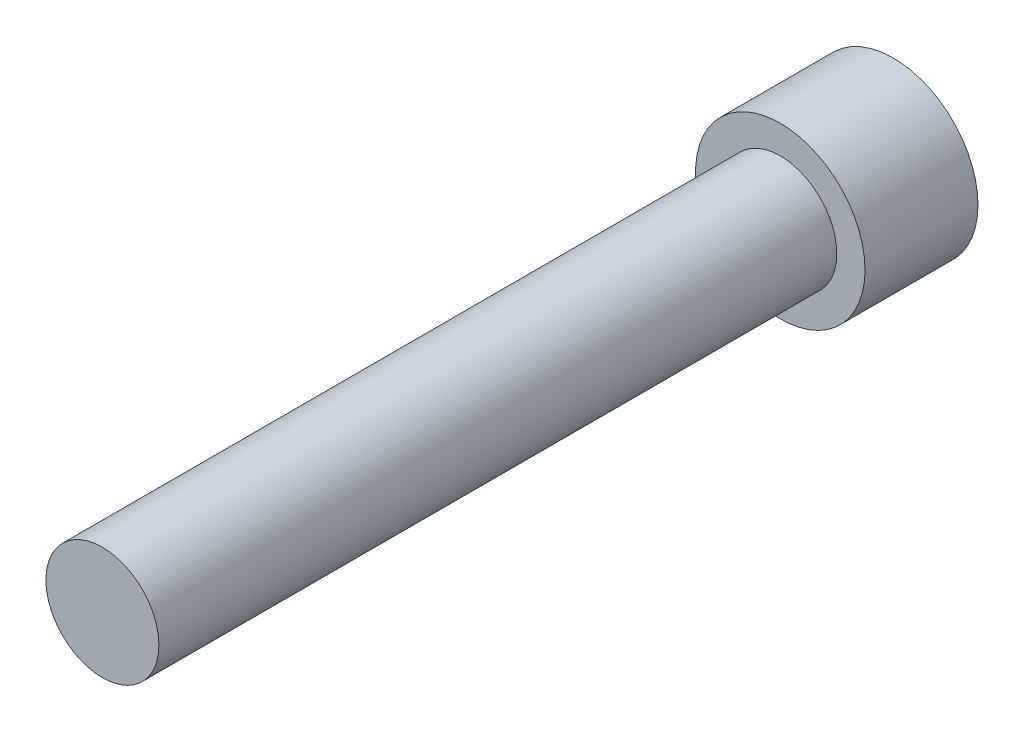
ISO-10303-21;
HEADER;
FILE_DESCRIPTION(('STEP AP214'),'2;1');
FILE_NAME('part.step','',(''),(''),'','','');
FILE_SCHEMA(('AUTOMOTIVE_DESIGN { 1 0 10303 214 1 1 1 1 }'));
ENDSEC;
DATA;
#1=APPLICATION_CONTEXT('core data for automotive mechanical design processes');
#2=APPLICATION_PROTOCOL_DEFINITION('international standard','automotive_design',2000,#1);
#3=PRODUCT_CONTEXT('',#1,'mechanical');
#4=PRODUCT('Part','Part','',(#3));
#5=PRODUCT_RELATED_PRODUCT_CATEGORY('part','',(#4));
#6=PRODUCT_DEFINITION_FORMATION('','',#4);
#7=PRODUCT_DEFINITION_CONTEXT('part definition',#1,'design');
#8=PRODUCT_DEFINITION('design','',#6,#7);
#9=PRODUCT_DEFINITION_SHAPE('','',#8);
#10=(LENGTH_UNIT() NAMED_UNIT(*) SI_UNIT(.MILLI.,.METRE.));
#11=(NAMED_UNIT(*) PLANE_ANGLE_UNIT() SI_UNIT($,.RADIAN.));
#12=(NAMED_UNIT(*) SI_UNIT($,.STERADIAN.) SOLID_ANGLE_UNIT());
#13=UNCERTAINTY_MEASURE_WITH_UNIT(LENGTH_MEASURE(1.E-05),#10,'distance_accuracy_value','');
#14=(GEOMETRIC_REPRESENTATION_CONTEXT(3) GLOBAL_UNCERTAINTY_ASSIGNED_CONTEXT((#13)) GLOBAL_UNIT_ASSIGNED_CONTEXT((#10,
#11,#12)) REPRESENTATION_CONTEXT('',''));
#15=CARTESIAN_POINT('',(0.,0.,0.));
#16=DIRECTION('',(0.,0.,1.));
#17=DIRECTION('',(1.,0.,0.));
#18=AXIS2_PLACEMENT_3D('',#15,#16,#17);
#19=CARTESIAN_POINT('',(0.,-4.7625,-6.35));
#20=DIRECTION('',(0.,0.,-1.));
#21=DIRECTION('',(-1.,0.,0.));
#22=AXIS2_PLACEMENT_3D('',#19,#20,#21);
#23=PLANE('',#22);
#24=DIRECTION('',(0.866025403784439,-0.5,0.));
#25=VECTOR('',#24,1.);
#26=CARTESIAN_POINT('',(0.,2.7569630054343,-6.35));
#27=LINE('',#26,#25);
#28=CARTESIAN_POINT('',(0.,2.7569630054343,-6.35));
#29=VERTEX_POINT('',#28);
#30=CARTESIAN_POINT('',(2.3876,1.37848150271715,-6.35));
#31=VERTEX_POINT('',#30);
#32=EDGE_CURVE('E47',#29,#31,#27,.T.);
#33=ORIENTED_EDGE('',*,*,#32,.F.);
#34=DIRECTION('',(0.866025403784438,0.5,0.));
#35=VECTOR('',#34,1.);
#36=CARTESIAN_POINT('',(-2.3876,1.37848150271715,-6.35));
#37=LINE('',#36,#35);
#38=CARTESIAN_POINT('',(-2.3876,1.37848150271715,-6.35));
#39=VERTEX_POINT('',#38);
#40=EDGE_CURVE('E130',#39,#29,#37,.T.);
#41=ORIENTED_EDGE('',*,*,#40,.F.);
#42=DIRECTION('',(0.,1.,0.));
#43=VECTOR('',#42,1.);
#44=CARTESIAN_POINT('',(-2.3876,-1.37848150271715,-6.35));
#45=LINE('',#44,#43);
#46=CARTESIAN_POINT('',(-2.3876,-1.37848150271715,-6.35));
#47=VERTEX_POINT('',#46);
#48=EDGE_CURVE('E128',#47,#39,#45,.T.);
#49=ORIENTED_EDGE('',*,*,#48,.F.);
#50=DIRECTION('',(-0.866025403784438,0.5,0.));
#51=VECTOR('',#50,1.);
#52=CARTESIAN_POINT('',(0.,-2.7569630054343,-6.35));
#53=LINE('',#52,#51);
#54=CARTESIAN_POINT('',(0.,-2.7569630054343,-6.35));
#55=VERTEX_POINT('',#54);
#56=EDGE_CURVE('E95',#55,#47,#53,.T.);
#57=ORIENTED_EDGE('',*,*,#56,.F.);
#58=DIRECTION('',(-0.866025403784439,-0.5,0.));
#59=VECTOR('',#58,1.);
#60=CARTESIAN_POINT('',(2.3876,-1.37848150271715,-6.35));
#61=LINE('',#60,#59);
#62=CARTESIAN_POINT('',(2.3876,-1.37848150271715,-6.35));
#63=VERTEX_POINT('',#62);
#64=EDGE_CURVE('E124',#63,#55,#61,.T.);
#65=ORIENTED_EDGE('',*,*,#64,.F.);
#66=DIRECTION('',(0.,-1.,0.));
#67=VECTOR('',#66,1.);
#68=CARTESIAN_POINT('',(2.3876,1.37848150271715,-6.35));
#69=LINE('',#68,#67);
#70=EDGE_CURVE('E121',#31,#63,#69,.T.);
#71=ORIENTED_EDGE('',*,*,#70,.F.);
#72=EDGE_LOOP('',(#33,#41,#49,#57,#65,#71));
#73=FACE_BOUND('',#72,.T.);
#74=CARTESIAN_POINT('',(0.,0.,-6.35));
#75=DIRECTION('',(0.,0.,1.));
#76=DIRECTION('',(1.,0.,0.));
#77=AXIS2_PLACEMENT_3D('',#74,#75,#76);
#78=CIRCLE('',#77,4.7625);
#79=CARTESIAN_POINT('',(4.7625,0.,-6.35));
#80=VERTEX_POINT('',#79);
#81=EDGE_CURVE('E11',#80,#80,#78,.T.);
#82=ORIENTED_EDGE('',*,*,#81,.F.);
#83=EDGE_LOOP('',(#82));
#84=FACE_BOUND('',#83,.T.);
#85=ADVANCED_FACE('F33',(#73,#84),#23,.T.);
#86=CARTESIAN_POINT('',(0.,0.,38.1));
#87=DIRECTION('',(0.,0.,1.));
#88=DIRECTION('',(1.,0.,0.));
#89=AXIS2_PLACEMENT_3D('',#86,#87,#88);
#90=CYLINDRICAL_SURFACE('',#89,4.7625);
#91=ORIENTED_EDGE('',*,*,#81,.T.);
#92=EDGE_LOOP('',(#91));
#93=FACE_BOUND('',#92,.T.);
#94=CARTESIAN_POINT('',(0.,0.,0.));
#95=DIRECTION('',(0.,0.,1.));
#96=DIRECTION('',(1.,0.,0.));
#97=AXIS2_PLACEMENT_3D('',#94,#95,#96);
#98=CIRCLE('',#97,4.7625);
#99=CARTESIAN_POINT('',(4.7625,0.,0.));
#100=VERTEX_POINT('',#99);
#101=EDGE_CURVE('E40',#100,#100,#98,.T.);
#102=ORIENTED_EDGE('',*,*,#101,.F.);
#103=EDGE_LOOP('',(#102));
#104=FACE_BOUND('',#103,.T.);
#105=ADVANCED_FACE('F150',(#93,#104),#90,.T.);
#106=CARTESIAN_POINT('',(0.,-3.175,0.));
#107=DIRECTION('',(0.,0.,1.));
#108=DIRECTION('',(1.,0.,0.));
#109=AXIS2_PLACEMENT_3D('',#106,#107,#108);
#110=PLANE('',#109);
#111=ORIENTED_EDGE('',*,*,#101,.T.);
#112=EDGE_LOOP('',(#111));
#113=FACE_BOUND('',#112,.T.);
#114=CARTESIAN_POINT('',(0.,0.,0.));
#115=DIRECTION('',(0.,0.,1.));
#116=DIRECTION('',(1.,0.,0.));
#117=AXIS2_PLACEMENT_3D('',#114,#115,#116);
#118=CIRCLE('',#117,3.175);
#119=CARTESIAN_POINT('',(3.175,0.,0.));
#120=VERTEX_POINT('',#119);
#121=EDGE_CURVE('E142',#120,#120,#118,.T.);
#122=ORIENTED_EDGE('',*,*,#121,.F.);
#123=EDGE_LOOP('',(#122));
#124=FACE_BOUND('',#123,.T.);
#125=ADVANCED_FACE('F147',(#113,#124),#110,.T.);
#126=CARTESIAN_POINT('',(0.,0.,38.1));
#127=DIRECTION('',(0.,0.,1.));
#128=DIRECTION('',(1.,0.,0.));
#129=AXIS2_PLACEMENT_3D('',#126,#127,#128);
#130=CYLINDRICAL_SURFACE('',#129,3.175);
#131=ORIENTED_EDGE('',*,*,#121,.T.);
#132=EDGE_LOOP('',(#131));
#133=FACE_BOUND('',#132,.T.);
#134=CARTESIAN_POINT('',(0.,0.,38.1));
#135=DIRECTION('',(0.,0.,1.));
#136=DIRECTION('',(1.,0.,0.));
#137=AXIS2_PLACEMENT_3D('',#134,#135,#136);
#138=CIRCLE('',#137,3.175);
#139=CARTESIAN_POINT('',(3.175,0.,38.1));
#140=VERTEX_POINT('',#139);
#141=EDGE_CURVE('E134',#140,#140,#138,.T.);
#142=ORIENTED_EDGE('',*,*,#141,.F.);
#143=EDGE_LOOP('',(#142));
#144=FACE_BOUND('',#143,.T.);
#145=ADVANCED_FACE('F157',(#133,#144),#130,.T.);
#146=CARTESIAN_POINT('',(0.,0.,38.1));
#147=DIRECTION('',(0.,0.,1.));
#148=DIRECTION('',(1.,0.,0.));
#149=AXIS2_PLACEMENT_3D('',#146,#147,#148);
#150=PLANE('',#149);
#151=ORIENTED_EDGE('',*,*,#141,.T.);
#152=EDGE_LOOP('',(#151));
#153=FACE_BOUND('',#152,.T.);
#154=ADVANCED_FACE('F163',(#153),#150,.T.);
#155=CARTESIAN_POINT('',(0.,2.7569630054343,-2.794));
#156=DIRECTION('',(0.5,0.866025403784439,0.));
#157=DIRECTION('',(-0.866025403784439,0.5,0.));
#158=AXIS2_PLACEMENT_3D('',#155,#156,#157);
#159=PLANE('',#158);
#160=ORIENTED_EDGE('',*,*,#32,.T.);
#161=DIRECTION('',(0.,0.,-1.));
#162=VECTOR('',#161,1.);
#163=CARTESIAN_POINT('',(2.3876,1.37848150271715,-2.794));
#164=LINE('',#163,#162);
#165=CARTESIAN_POINT('',(2.3876,1.37848150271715,-2.794));
#166=VERTEX_POINT('',#165);
#167=EDGE_CURVE('E77',#166,#31,#164,.T.);
#168=ORIENTED_EDGE('',*,*,#167,.F.);
#169=DIRECTION('',(0.866025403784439,-0.5,0.));
#170=VECTOR('',#169,1.);
#171=CARTESIAN_POINT('',(0.,2.7569630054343,-2.794));
#172=LINE('',#171,#170);
#173=CARTESIAN_POINT('',(0.,2.7569630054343,-2.794));
#174=VERTEX_POINT('',#173);
#175=EDGE_CURVE('E132',#174,#166,#172,.T.);
#176=ORIENTED_EDGE('',*,*,#175,.F.);
#177=DIRECTION('',(0.,0.,-1.));
#178=VECTOR('',#177,1.);
#179=CARTESIAN_POINT('',(0.,2.7569630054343,-2.794));
#180=LINE('',#179,#178);
#181=EDGE_CURVE('E55',#174,#29,#180,.T.);
#182=ORIENTED_EDGE('',*,*,#181,.T.);
#183=EDGE_LOOP('',(#160,#168,#176,#182));
#184=FACE_BOUND('',#183,.T.);
#185=ADVANCED_FACE('F167',(#184),#159,.F.);
#186=CARTESIAN_POINT('',(-2.3876,1.37848150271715,-2.794));
#187=DIRECTION('',(-0.5,0.866025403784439,0.));
#188=DIRECTION('',(-0.866025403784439,-0.5,0.));
#189=AXIS2_PLACEMENT_3D('',#186,#187,#188);
#190=PLANE('',#189);
#191=ORIENTED_EDGE('',*,*,#40,.T.);
#192=ORIENTED_EDGE('',*,*,#181,.F.);
#193=DIRECTION('',(0.866025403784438,0.5,0.));
#194=VECTOR('',#193,1.);
#195=CARTESIAN_POINT('',(-2.3876,1.37848150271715,-2.794));
#196=LINE('',#195,#194);
#197=CARTESIAN_POINT('',(-2.3876,1.37848150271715,-2.794));
#198=VERTEX_POINT('',#197);
#199=EDGE_CURVE('E107',#198,#174,#196,.T.);
#200=ORIENTED_EDGE('',*,*,#199,.F.);
#201=DIRECTION('',(0.,0.,-1.));
#202=VECTOR('',#201,1.);
#203=CARTESIAN_POINT('',(-2.3876,1.37848150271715,-2.794));
#204=LINE('',#203,#202);
#205=EDGE_CURVE('E99',#198,#39,#204,.T.);
#206=ORIENTED_EDGE('',*,*,#205,.T.);
#207=EDGE_LOOP('',(#191,#192,#200,#206));
#208=FACE_BOUND('',#207,.T.);
#209=ADVANCED_FACE('F171',(#208),#190,.F.);
#210=CARTESIAN_POINT('',(-2.3876,-1.37848150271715,-2.794));
#211=DIRECTION('',(-1.,0.,0.));
#212=DIRECTION('',(0.,0.,1.));
#213=AXIS2_PLACEMENT_3D('',#210,#211,#212);
#214=PLANE('',#213);
#215=ORIENTED_EDGE('',*,*,#48,.T.);
#216=ORIENTED_EDGE('',*,*,#205,.F.);
#217=DIRECTION('',(0.,1.,0.));
#218=VECTOR('',#217,1.);
#219=CARTESIAN_POINT('',(-2.3876,-1.37848150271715,-2.794));
#220=LINE('',#219,#218);
#221=CARTESIAN_POINT('',(-2.3876,-1.37848150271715,-2.794));
#222=VERTEX_POINT('',#221);
#223=EDGE_CURVE('E103',#222,#198,#220,.T.);
#224=ORIENTED_EDGE('',*,*,#223,.F.);
#225=DIRECTION('',(0.,0.,-1.));
#226=VECTOR('',#225,1.);
#227=CARTESIAN_POINT('',(-2.3876,-1.37848150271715,-2.794));
#228=LINE('',#227,#226);
#229=EDGE_CURVE('E88',#222,#47,#228,.T.);
#230=ORIENTED_EDGE('',*,*,#229,.T.);
#231=EDGE_LOOP('',(#215,#216,#224,#230));
#232=FACE_BOUND('',#231,.T.);
#233=ADVANCED_FACE('F104',(#232),#214,.F.);
#234=CARTESIAN_POINT('',(0.,-2.7569630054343,-2.794));
#235=DIRECTION('',(-0.5,-0.866025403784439,0.));
#236=DIRECTION('',(0.866025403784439,-0.5,0.));
#237=AXIS2_PLACEMENT_3D('',#234,#235,#236);
#238=PLANE('',#237);
#239=ORIENTED_EDGE('',*,*,#56,.T.);
#240=ORIENTED_EDGE('',*,*,#229,.F.);
#241=DIRECTION('',(-0.866025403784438,0.5,0.));
#242=VECTOR('',#241,1.);
#243=CARTESIAN_POINT('',(0.,-2.7569630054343,-2.794));
#244=LINE('',#243,#242);
#245=CARTESIAN_POINT('',(0.,-2.7569630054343,-2.794));
#246=VERTEX_POINT('',#245);
#247=EDGE_CURVE('E92',#246,#222,#244,.T.);
#248=ORIENTED_EDGE('',*,*,#247,.F.);
#249=DIRECTION('',(0.,0.,-1.));
#250=VECTOR('',#249,1.);
#251=CARTESIAN_POINT('',(0.,-2.7569630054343,-2.794));
#252=LINE('',#251,#250);
#253=EDGE_CURVE('E100',#246,#55,#252,.T.);
#254=ORIENTED_EDGE('',*,*,#253,.T.);
#255=EDGE_LOOP('',(#239,#240,#248,#254));
#256=FACE_BOUND('',#255,.T.);
#257=ADVANCED_FACE('F90',(#256),#238,.F.);
#258=CARTESIAN_POINT('',(2.3876,-1.37848150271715,-2.794));
#259=DIRECTION('',(0.5,-0.866025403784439,0.));
#260=DIRECTION('',(0.866025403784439,0.5,0.));
#261=AXIS2_PLACEMENT_3D('',#258,#259,#260);
#262=PLANE('',#261);
#263=ORIENTED_EDGE('',*,*,#64,.T.);
#264=ORIENTED_EDGE('',*,*,#253,.F.);
#265=DIRECTION('',(-0.866025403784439,-0.5,0.));
#266=VECTOR('',#265,1.);
#267=CARTESIAN_POINT('',(2.3876,-1.37848150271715,-2.794));
#268=LINE('',#267,#266);
#269=CARTESIAN_POINT('',(2.3876,-1.37848150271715,-2.794));
#270=VERTEX_POINT('',#269);
#271=EDGE_CURVE('E113',#270,#246,#268,.T.);
#272=ORIENTED_EDGE('',*,*,#271,.F.);
#273=DIRECTION('',(0.,0.,-1.));
#274=VECTOR('',#273,1.);
#275=CARTESIAN_POINT('',(2.3876,-1.37848150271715,-2.794));
#276=LINE('',#275,#274);
#277=EDGE_CURVE('E137',#270,#63,#276,.T.);
#278=ORIENTED_EDGE('',*,*,#277,.T.);
#279=EDGE_LOOP('',(#263,#264,#272,#278));
#280=FACE_BOUND('',#279,.T.);
#281=ADVANCED_FACE('F175',(#280),#262,.F.);
#282=CARTESIAN_POINT('',(2.3876,1.37848150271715,-2.794));
#283=DIRECTION('',(1.,0.,0.));
#284=DIRECTION('',(0.,0.,-1.));
#285=AXIS2_PLACEMENT_3D('',#282,#283,#284);
#286=PLANE('',#285);
#287=ORIENTED_EDGE('',*,*,#70,.T.);
#288=ORIENTED_EDGE('',*,*,#277,.F.);
#289=DIRECTION('',(0.,-1.,0.));
#290=VECTOR('',#289,1.);
#291=CARTESIAN_POINT('',(2.3876,1.37848150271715,-2.794));
#292=LINE('',#291,#290);
#293=EDGE_CURVE('E115',#166,#270,#292,.T.);
#294=ORIENTED_EDGE('',*,*,#293,.F.);
#295=ORIENTED_EDGE('',*,*,#167,.T.);
#296=EDGE_LOOP('',(#287,#288,#294,#295));
#297=FACE_BOUND('',#296,.T.);
#298=ADVANCED_FACE('F172',(#297),#286,.F.);
#299=CARTESIAN_POINT('',(0.,2.7569630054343,-2.794));
#300=DIRECTION('',(0.,0.,1.));
#301=DIRECTION('',(1.,0.,0.));
#302=AXIS2_PLACEMENT_3D('',#299,#300,#301);
#303=PLANE('',#302);
#304=ORIENTED_EDGE('',*,*,#175,.T.);
#305=ORIENTED_EDGE('',*,*,#293,.T.);
#306=ORIENTED_EDGE('',*,*,#271,.T.);
#307=ORIENTED_EDGE('',*,*,#247,.T.);
#308=ORIENTED_EDGE('',*,*,#223,.T.);
#309=ORIENTED_EDGE('',*,*,#199,.T.);
#310=EDGE_LOOP('',(#304,#305,#306,#307,#308,#309));
#311=FACE_BOUND('',#310,.T.);
#312=ADVANCED_FACE('F110',(#311),#303,.F.);
#313=CLOSED_SHELL('',(#85,#105,#125,#145,#154,#185,#209,#233,#257,#281,#298,#312));
#314=MANIFOLD_SOLID_BREP('B2',#313);
#315=ADVANCED_BREP_SHAPE_REPRESENTATION('',(#18,#314),#14);
#316=SHAPE_DEFINITION_REPRESENTATION(#9,#315);
ENDSEC;
END-ISO-10303-21;
